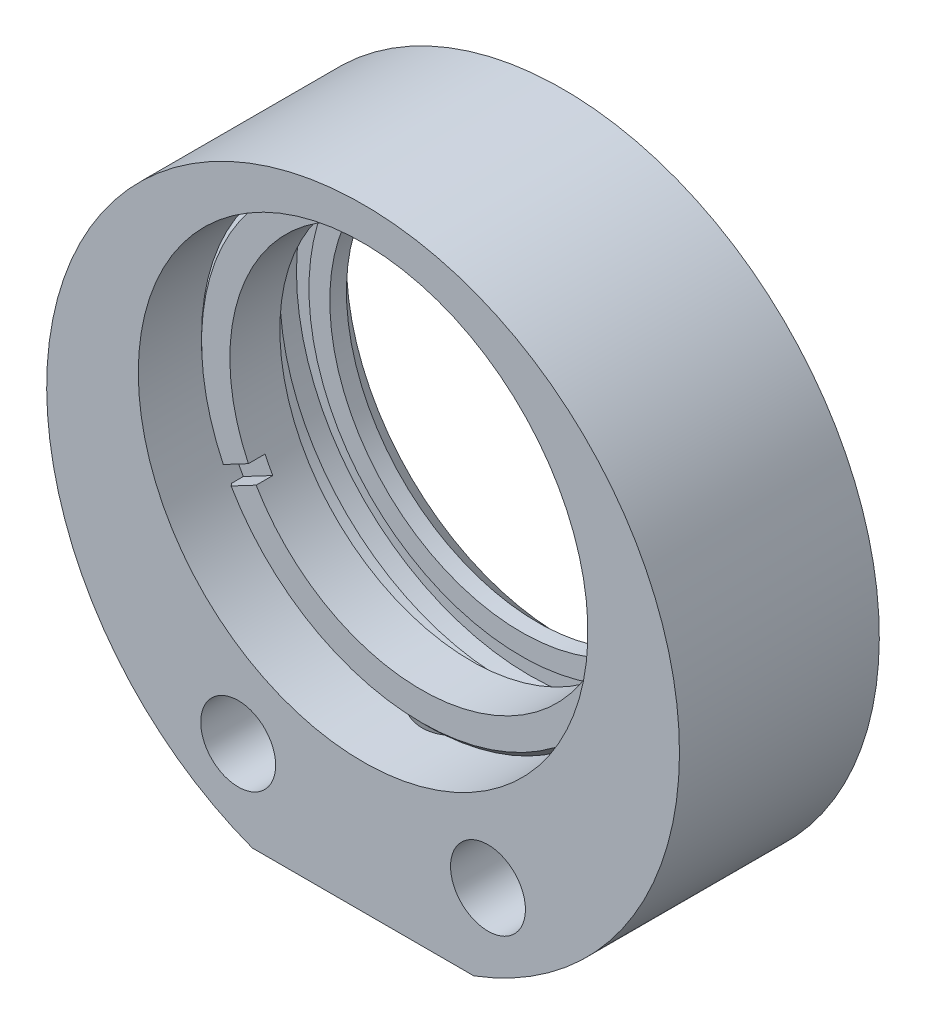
ISO-10303-21;
HEADER;
FILE_DESCRIPTION(('STEP AP214'),'2;1');
FILE_NAME('part.step','',(''),(''),'','','');
FILE_SCHEMA(('AUTOMOTIVE_DESIGN { 1 0 10303 214 1 1 1 1 }'));
ENDSEC;
DATA;
#1=APPLICATION_CONTEXT('core data for automotive mechanical design processes');
#2=APPLICATION_PROTOCOL_DEFINITION('international standard','automotive_design',2000,#1);
#3=PRODUCT_CONTEXT('',#1,'mechanical');
#4=PRODUCT('Part','Part','',(#3));
#5=PRODUCT_RELATED_PRODUCT_CATEGORY('part','',(#4));
#6=PRODUCT_DEFINITION_FORMATION('','',#4);
#7=PRODUCT_DEFINITION_CONTEXT('part definition',#1,'design');
#8=PRODUCT_DEFINITION('design','',#6,#7);
#9=PRODUCT_DEFINITION_SHAPE('','',#8);
#10=(LENGTH_UNIT() NAMED_UNIT(*) SI_UNIT(.MILLI.,.METRE.));
#11=(NAMED_UNIT(*) PLANE_ANGLE_UNIT() SI_UNIT($,.RADIAN.));
#12=(NAMED_UNIT(*) SI_UNIT($,.STERADIAN.) SOLID_ANGLE_UNIT());
#13=UNCERTAINTY_MEASURE_WITH_UNIT(LENGTH_MEASURE(1.E-05),#10,'distance_accuracy_value','');
#14=(GEOMETRIC_REPRESENTATION_CONTEXT(3) GLOBAL_UNCERTAINTY_ASSIGNED_CONTEXT((#13)) GLOBAL_UNIT_ASSIGNED_CONTEXT((#10,
#11,#12)) REPRESENTATION_CONTEXT('',''));
#15=CARTESIAN_POINT('',(0.,0.,0.));
#16=DIRECTION('',(0.,0.,1.));
#17=DIRECTION('',(1.,0.,0.));
#18=AXIS2_PLACEMENT_3D('',#15,#16,#17);
#19=CARTESIAN_POINT('',(-13.8252716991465,-4.37936876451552,8.5));
#20=DIRECTION('',(0.467610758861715,-0.883934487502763,0.));
#21=DIRECTION('',(0.883934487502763,0.467610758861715,0.));
#22=AXIS2_PLACEMENT_3D('',#19,#20,#21);
#23=PLANE('',#22);
#24=DIRECTION('',(0.883934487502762,0.467610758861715,0.));
#25=VECTOR('',#24,1.);
#26=CARTESIAN_POINT('',(-11.6911228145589,-3.25038127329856,7.5));
#27=LINE('',#26,#25);
#28=CARTESIAN_POINT('',(-11.6911228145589,-3.25038127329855,7.5));
#29=VERTEX_POINT('',#28);
#30=CARTESIAN_POINT('',(-9.92182869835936,-2.314405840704,7.5));
#31=VERTEX_POINT('',#30);
#32=EDGE_CURVE('E159',#29,#31,#27,.T.);
#33=ORIENTED_EDGE('',*,*,#32,.F.);
#34=DIRECTION('',(0.,0.,1.));
#35=VECTOR('',#34,1.);
#36=CARTESIAN_POINT('',(-11.6911228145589,-3.25038127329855,8.5));
#37=LINE('',#36,#35);
#38=CARTESIAN_POINT('',(-11.6911228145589,-3.25038127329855,8.2));
#39=VERTEX_POINT('',#38);
#40=EDGE_CURVE('E146',#39,#29,#37,.F.);
#41=ORIENTED_EDGE('',*,*,#40,.F.);
#42=CARTESIAN_POINT('',(-11.4257562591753,-3.10999953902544,8.5));
#43=CARTESIAN_POINT('',(-11.4699843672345,-3.13339667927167,8.45000039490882));
#44=CARTESIAN_POINT('',(-11.5142123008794,-3.15679372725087,8.40000059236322));
#45=CARTESIAN_POINT('',(-11.6026678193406,-3.20358763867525,8.30000059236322));
#46=CARTESIAN_POINT('',(-11.6468954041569,-3.22698450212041,8.25000039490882));
#47=CARTESIAN_POINT('',(-11.6911228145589,-3.25038127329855,8.2));
#48=B_SPLINE_CURVE_WITH_KNOTS('',3,(#42,#43,#44,#45,#46,#47),.UNSPECIFIED.,.F.,.F.,(4,2,4),(0.,
0.212206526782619,0.424413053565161),.UNSPECIFIED.);
#49=CARTESIAN_POINT('',(-11.4257562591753,-3.10999953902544,8.5));
#50=VERTEX_POINT('',#49);
#51=EDGE_CURVE('E20',#50,#39,#48,.T.);
#52=ORIENTED_EDGE('',*,*,#51,.F.);
#53=DIRECTION('',(0.883934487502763,0.467610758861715,0.));
#54=VECTOR('',#53,1.);
#55=CARTESIAN_POINT('',(-13.8252716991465,-4.37936876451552,8.5));
#56=LINE('',#55,#54);
#57=CARTESIAN_POINT('',(-9.92182869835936,-2.314405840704,8.5));
#58=VERTEX_POINT('',#57);
#59=EDGE_CURVE('E132',#58,#50,#56,.F.);
#60=ORIENTED_EDGE('',*,*,#59,.F.);
#61=DIRECTION('',(0.,0.,1.));
#62=VECTOR('',#61,1.);
#63=CARTESIAN_POINT('',(-9.92182869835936,-2.314405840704,8.5));
#64=LINE('',#63,#62);
#65=EDGE_CURVE('E161',#31,#58,#64,.T.);
#66=ORIENTED_EDGE('',*,*,#65,.F.);
#67=EDGE_LOOP('',(#33,#41,#52,#60,#66));
#68=FACE_BOUND('',#67,.T.);
#69=ADVANCED_FACE('F16',(#68),#23,.F.);
#70=CARTESIAN_POINT('',(12.6191860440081,10.7413366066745,8.5));
#71=DIRECTION('',(-0.467610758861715,0.883934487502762,0.));
#72=DIRECTION('',(-0.883934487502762,-0.467610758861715,0.));
#73=AXIS2_PLACEMENT_3D('',#70,#71,#72);
#74=PLANE('',#73);
#75=DIRECTION('',(-0.883934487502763,-0.467610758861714,0.));
#76=VECTOR('',#75,1.);
#77=CARTESIAN_POINT('',(11.6911228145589,10.2503812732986,7.5));
#78=LINE('',#77,#76);
#79=CARTESIAN_POINT('',(11.6911228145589,10.2503812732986,7.5));
#80=VERTEX_POINT('',#79);
#81=CARTESIAN_POINT('',(9.92182869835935,9.314405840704,7.5));
#82=VERTEX_POINT('',#81);
#83=EDGE_CURVE('E454',#80,#82,#78,.T.);
#84=ORIENTED_EDGE('',*,*,#83,.F.);
#85=DIRECTION('',(0.,0.,1.));
#86=VECTOR('',#85,1.);
#87=CARTESIAN_POINT('',(11.6911228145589,10.2503812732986,8.5));
#88=LINE('',#87,#86);
#89=CARTESIAN_POINT('',(11.6911228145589,10.2503812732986,8.2));
#90=VERTEX_POINT('',#89);
#91=EDGE_CURVE('E344',#90,#80,#88,.F.);
#92=ORIENTED_EDGE('',*,*,#91,.F.);
#93=CARTESIAN_POINT('',(11.4257562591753,10.1099995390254,8.5));
#94=CARTESIAN_POINT('',(11.4699843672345,10.1333966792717,8.45000039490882));
#95=CARTESIAN_POINT('',(11.5142123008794,10.1567937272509,8.40000059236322));
#96=CARTESIAN_POINT('',(11.6026678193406,10.2035876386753,8.30000059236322));
#97=CARTESIAN_POINT('',(11.6468954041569,10.2269845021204,8.25000039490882));
#98=CARTESIAN_POINT('',(11.6911228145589,10.2503812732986,8.2));
#99=B_SPLINE_CURVE_WITH_KNOTS('',3,(#93,#94,#95,#96,#97,#98),.UNSPECIFIED.,.F.,.F.,(4,2,4),(0.,
0.212206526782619,0.424413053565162),.UNSPECIFIED.);
#100=CARTESIAN_POINT('',(11.4257562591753,10.1099995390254,8.5));
#101=VERTEX_POINT('',#100);
#102=EDGE_CURVE('E171',#101,#90,#99,.T.);
#103=ORIENTED_EDGE('',*,*,#102,.F.);
#104=DIRECTION('',(-0.883934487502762,-0.467610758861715,0.));
#105=VECTOR('',#104,1.);
#106=CARTESIAN_POINT('',(12.6191860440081,10.7413366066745,8.5));
#107=LINE('',#106,#105);
#108=CARTESIAN_POINT('',(9.92182869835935,9.314405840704,8.5));
#109=VERTEX_POINT('',#108);
#110=EDGE_CURVE('E164',#109,#101,#107,.F.);
#111=ORIENTED_EDGE('',*,*,#110,.F.);
#112=DIRECTION('',(0.,0.,1.));
#113=VECTOR('',#112,1.);
#114=CARTESIAN_POINT('',(9.92182869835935,9.314405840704,8.5));
#115=LINE('',#114,#113);
#116=EDGE_CURVE('E167',#82,#109,#115,.T.);
#117=ORIENTED_EDGE('',*,*,#116,.F.);
#118=EDGE_LOOP('',(#84,#92,#103,#111,#117));
#119=FACE_BOUND('',#118,.T.);
#120=ADVANCED_FACE('F347',(#119),#74,.F.);
#121=CARTESIAN_POINT('',(-0.603042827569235,3.18098392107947,7.5));
#122=DIRECTION('',(0.,0.,1.));
#123=DIRECTION('',(0.,-1.,0.));
#124=AXIS2_PLACEMENT_3D('',#121,#122,#123);
#125=PLANE('',#124);
#126=CARTESIAN_POINT('',(0.,3.5,7.5));
#127=DIRECTION('',(0.,0.,-1.));
#128=DIRECTION('',(-1.,0.,0.));
#129=AXIS2_PLACEMENT_3D('',#126,#127,#128);
#130=CIRCLE('',#129,13.5);
#131=CARTESIAN_POINT('',(-12.1587335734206,-2.36644678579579,7.5));
#132=VERTEX_POINT('',#131);
#133=EDGE_CURVE('E461',#132,#29,#130,.F.);
#134=ORIENTED_EDGE('',*,*,#133,.T.);
#135=ORIENTED_EDGE('',*,*,#32,.T.);
#136=CARTESIAN_POINT('',(0.,3.5,7.5));
#137=DIRECTION('',(0.,0.,1.));
#138=DIRECTION('',(1.,0.,0.));
#139=AXIS2_PLACEMENT_3D('',#136,#137,#138);
#140=CIRCLE('',#139,11.5);
#141=CARTESIAN_POINT('',(-10.3894394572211,-1.43047135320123,7.5));
#142=VERTEX_POINT('',#141);
#143=EDGE_CURVE('E345',#31,#142,#140,.F.);
#144=ORIENTED_EDGE('',*,*,#143,.T.);
#145=DIRECTION('',(-0.883934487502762,-0.467610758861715,0.));
#146=VECTOR('',#145,1.);
#147=CARTESIAN_POINT('',(12.6191860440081,10.7413366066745,7.5));
#148=LINE('',#147,#146);
#149=EDGE_CURVE('E450',#142,#132,#148,.T.);
#150=ORIENTED_EDGE('',*,*,#149,.T.);
#151=EDGE_LOOP('',(#134,#135,#144,#150));
#152=FACE_BOUND('',#151,.T.);
#153=ADVANCED_FACE('F351',(#152),#125,.T.);
#154=CARTESIAN_POINT('',(-0.603042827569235,3.18098392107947,7.5));
#155=DIRECTION('',(0.,0.,1.));
#156=DIRECTION('',(0.,-1.,0.));
#157=AXIS2_PLACEMENT_3D('',#154,#155,#156);
#158=PLANE('',#157);
#159=CARTESIAN_POINT('',(0.,3.5,7.5));
#160=DIRECTION('',(0.,0.,-1.));
#161=DIRECTION('',(-1.,0.,0.));
#162=AXIS2_PLACEMENT_3D('',#159,#160,#161);
#163=CIRCLE('',#162,13.5);
#164=CARTESIAN_POINT('',(12.1587335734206,9.36644678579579,7.5));
#165=VERTEX_POINT('',#164);
#166=EDGE_CURVE('E466',#165,#80,#163,.F.);
#167=ORIENTED_EDGE('',*,*,#166,.T.);
#168=ORIENTED_EDGE('',*,*,#83,.T.);
#169=CARTESIAN_POINT('',(0.,3.5,7.5));
#170=DIRECTION('',(0.,0.,1.));
#171=DIRECTION('',(1.,0.,0.));
#172=AXIS2_PLACEMENT_3D('',#169,#170,#171);
#173=CIRCLE('',#172,11.5);
#174=CARTESIAN_POINT('',(10.3894394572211,8.43047135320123,7.5));
#175=VERTEX_POINT('',#174);
#176=EDGE_CURVE('E463',#82,#175,#173,.F.);
#177=ORIENTED_EDGE('',*,*,#176,.T.);
#178=DIRECTION('',(0.883934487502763,0.467610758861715,0.));
#179=VECTOR('',#178,1.);
#180=CARTESIAN_POINT('',(-13.8252716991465,-4.37936876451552,7.5));
#181=LINE('',#180,#179);
#182=EDGE_CURVE('E445',#175,#165,#181,.T.);
#183=ORIENTED_EDGE('',*,*,#182,.T.);
#184=EDGE_LOOP('',(#167,#168,#177,#183));
#185=FACE_BOUND('',#184,.T.);
#186=ADVANCED_FACE('F356',(#185),#158,.T.);
#187=CARTESIAN_POINT('',(0.,3.5,2.));
#188=DIRECTION('',(0.,0.,-1.));
#189=DIRECTION('',(-1.,0.,0.));
#190=AXIS2_PLACEMENT_3D('',#187,#188,#189);
#191=PLANE('',#190);
#192=CARTESIAN_POINT('',(0.,3.5,2.));
#193=DIRECTION('',(0.,0.,1.));
#194=DIRECTION('',(1.,0.,0.));
#195=AXIS2_PLACEMENT_3D('',#192,#193,#194);
#196=CIRCLE('',#195,12.75);
#197=CARTESIAN_POINT('',(12.75,3.5,2.));
#198=VERTEX_POINT('',#197);
#199=EDGE_CURVE('E390',#198,#198,#196,.T.);
#200=ORIENTED_EDGE('',*,*,#199,.F.);
#201=EDGE_LOOP('',(#200));
#202=FACE_BOUND('',#201,.T.);
#203=CARTESIAN_POINT('',(0.,3.5,2.));
#204=DIRECTION('',(0.,0.,1.));
#205=DIRECTION('',(1.,0.,0.));
#206=AXIS2_PLACEMENT_3D('',#203,#204,#205);
#207=CIRCLE('',#206,14.);
#208=CARTESIAN_POINT('',(14.,3.5,2.));
#209=VERTEX_POINT('',#208);
#210=EDGE_CURVE('E393',#209,#209,#207,.T.);
#211=ORIENTED_EDGE('',*,*,#210,.T.);
#212=EDGE_LOOP('',(#211));
#213=FACE_BOUND('',#212,.T.);
#214=ADVANCED_FACE('F360',(#202,#213),#191,.F.);
#215=CARTESIAN_POINT('',(0.,3.5,5.5));
#216=DIRECTION('',(0.,0.,1.));
#217=DIRECTION('',(1.,0.,0.));
#218=AXIS2_PLACEMENT_3D('',#215,#216,#217);
#219=CYLINDRICAL_SURFACE('',#218,12.75);
#220=CARTESIAN_POINT('',(0.,3.5,6.));
#221=DIRECTION('',(0.,0.,1.));
#222=DIRECTION('',(1.,0.,0.));
#223=AXIS2_PLACEMENT_3D('',#220,#221,#222);
#224=CIRCLE('',#223,12.75);
#225=CARTESIAN_POINT('',(12.75,3.5,6.));
#226=VERTEX_POINT('',#225);
#227=EDGE_CURVE('E396',#226,#226,#224,.T.);
#228=ORIENTED_EDGE('',*,*,#227,.F.);
#229=EDGE_LOOP('',(#228));
#230=FACE_BOUND('',#229,.T.);
#231=CARTESIAN_POINT('',(0.,3.5,5.5));
#232=DIRECTION('',(0.,0.,1.));
#233=DIRECTION('',(1.,0.,0.));
#234=AXIS2_PLACEMENT_3D('',#231,#232,#233);
#235=CIRCLE('',#234,12.75);
#236=CARTESIAN_POINT('',(12.75,3.5,5.5));
#237=VERTEX_POINT('',#236);
#238=EDGE_CURVE('E387',#237,#237,#235,.F.);
#239=ORIENTED_EDGE('',*,*,#238,.F.);
#240=EDGE_LOOP('',(#239));
#241=FACE_BOUND('',#240,.T.);
#242=ADVANCED_FACE('F364',(#230,#241),#219,.T.);
#243=CARTESIAN_POINT('',(12.6191860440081,10.7413366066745,8.5));
#244=DIRECTION('',(-0.467610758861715,0.883934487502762,0.));
#245=DIRECTION('',(-0.883934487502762,-0.467610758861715,0.));
#246=AXIS2_PLACEMENT_3D('',#243,#244,#245);
#247=PLANE('',#246);
#248=DIRECTION('',(-0.883934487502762,-0.467610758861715,0.));
#249=VECTOR('',#248,1.);
#250=CARTESIAN_POINT('',(12.6191860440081,10.7413366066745,8.5));
#251=LINE('',#250,#249);
#252=CARTESIAN_POINT('',(-11.893367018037,-2.22606505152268,8.5));
#253=VERTEX_POINT('',#252);
#254=CARTESIAN_POINT('',(-10.3894394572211,-1.43047135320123,8.5));
#255=VERTEX_POINT('',#254);
#256=EDGE_CURVE('E448',#253,#255,#251,.F.);
#257=ORIENTED_EDGE('',*,*,#256,.F.);
#258=CARTESIAN_POINT('',(-12.1587335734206,-2.36644678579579,8.2));
#259=CARTESIAN_POINT('',(-12.1145061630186,-2.34305001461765,8.25000039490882));
#260=CARTESIAN_POINT('',(-12.0702785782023,-2.31965315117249,8.30000059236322));
#261=CARTESIAN_POINT('',(-11.9818230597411,-2.27285923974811,8.40000059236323));
#262=CARTESIAN_POINT('',(-11.9375951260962,-2.2494621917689,8.45000039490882));
#263=CARTESIAN_POINT('',(-11.893367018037,-2.22606505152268,8.5));
#264=B_SPLINE_CURVE_WITH_KNOTS('',3,(#258,#259,#260,#261,#262,#263),.UNSPECIFIED.,.F.,.F.,(4,2,
4),(0.,0.212206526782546,0.424413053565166),.UNSPECIFIED.);
#265=CARTESIAN_POINT('',(-12.1587335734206,-2.36644678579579,8.2));
#266=VERTEX_POINT('',#265);
#267=EDGE_CURVE('E331',#266,#253,#264,.T.);
#268=ORIENTED_EDGE('',*,*,#267,.F.);
#269=DIRECTION('',(0.,0.,1.));
#270=VECTOR('',#269,1.);
#271=CARTESIAN_POINT('',(-12.1587335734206,-2.3664467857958,8.5));
#272=LINE('',#271,#270);
#273=EDGE_CURVE('E453',#132,#266,#272,.T.);
#274=ORIENTED_EDGE('',*,*,#273,.F.);
#275=ORIENTED_EDGE('',*,*,#149,.F.);
#276=DIRECTION('',(0.,0.,1.));
#277=VECTOR('',#276,1.);
#278=CARTESIAN_POINT('',(-10.3894394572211,-1.43047135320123,5.5));
#279=LINE('',#278,#277);
#280=EDGE_CURVE('E399',#142,#255,#279,.T.);
#281=ORIENTED_EDGE('',*,*,#280,.T.);
#282=EDGE_LOOP('',(#257,#268,#274,#275,#281));
#283=FACE_BOUND('',#282,.T.);
#284=ADVANCED_FACE('F367',(#283),#247,.F.);
#285=CARTESIAN_POINT('',(-13.8252716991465,-4.37936876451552,8.5));
#286=DIRECTION('',(0.467610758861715,-0.883934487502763,0.));
#287=DIRECTION('',(0.883934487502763,0.467610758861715,0.));
#288=AXIS2_PLACEMENT_3D('',#285,#286,#287);
#289=PLANE('',#288);
#290=DIRECTION('',(0.883934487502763,0.467610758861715,0.));
#291=VECTOR('',#290,1.);
#292=CARTESIAN_POINT('',(-13.8252716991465,-4.37936876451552,8.5));
#293=LINE('',#292,#291);
#294=CARTESIAN_POINT('',(11.893367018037,9.22606505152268,8.5));
#295=VERTEX_POINT('',#294);
#296=CARTESIAN_POINT('',(10.3894394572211,8.43047135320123,8.5));
#297=VERTEX_POINT('',#296);
#298=EDGE_CURVE('E385',#295,#297,#293,.F.);
#299=ORIENTED_EDGE('',*,*,#298,.F.);
#300=CARTESIAN_POINT('',(12.1587335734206,9.3664467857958,8.2));
#301=CARTESIAN_POINT('',(12.1145061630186,9.34305001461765,8.25000039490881));
#302=CARTESIAN_POINT('',(12.0702785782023,9.31965315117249,8.30000059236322));
#303=CARTESIAN_POINT('',(11.9818230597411,9.27285923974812,8.40000059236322));
#304=CARTESIAN_POINT('',(11.9375951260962,9.24946219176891,8.45000039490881));
#305=CARTESIAN_POINT('',(11.893367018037,9.22606505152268,8.49999999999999));
#306=B_SPLINE_CURVE_WITH_KNOTS('',3,(#300,#301,#302,#303,#304,#305),.UNSPECIFIED.,.F.,.F.,(4,2,
4),(0.,0.212206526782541,0.424413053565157),.UNSPECIFIED.);
#307=CARTESIAN_POINT('',(12.1587335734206,9.36644678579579,8.2));
#308=VERTEX_POINT('',#307);
#309=EDGE_CURVE('E380',#308,#295,#306,.T.);
#310=ORIENTED_EDGE('',*,*,#309,.F.);
#311=DIRECTION('',(0.,0.,1.));
#312=VECTOR('',#311,1.);
#313=CARTESIAN_POINT('',(12.1587335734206,9.3664467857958,8.5));
#314=LINE('',#313,#312);
#315=EDGE_CURVE('E386',#165,#308,#314,.T.);
#316=ORIENTED_EDGE('',*,*,#315,.F.);
#317=ORIENTED_EDGE('',*,*,#182,.F.);
#318=DIRECTION('',(0.,0.,1.));
#319=VECTOR('',#318,1.);
#320=CARTESIAN_POINT('',(10.3894394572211,8.43047135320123,5.5));
#321=LINE('',#320,#319);
#322=EDGE_CURVE('E404',#175,#297,#321,.T.);
#323=ORIENTED_EDGE('',*,*,#322,.T.);
#324=EDGE_LOOP('',(#299,#310,#316,#317,#323));
#325=FACE_BOUND('',#324,.T.);
#326=ADVANCED_FACE('F372',(#325),#289,.F.);
#327=CARTESIAN_POINT('',(0.,3.5,5.5));
#328=DIRECTION('',(0.,0.,-1.));
#329=DIRECTION('',(-1.,0.,0.));
#330=AXIS2_PLACEMENT_3D('',#327,#328,#329);
#331=PLANE('',#330);
#332=ORIENTED_EDGE('',*,*,#238,.T.);
#333=EDGE_LOOP('',(#332));
#334=FACE_BOUND('',#333,.T.);
#335=CARTESIAN_POINT('',(0.,3.5,5.5));
#336=DIRECTION('',(0.,0.,1.));
#337=DIRECTION('',(1.,0.,0.));
#338=AXIS2_PLACEMENT_3D('',#335,#336,#337);
#339=CIRCLE('',#338,11.5);
#340=CARTESIAN_POINT('',(11.5,3.5,5.5));
#341=VERTEX_POINT('',#340);
#342=EDGE_CURVE('E400',#341,#341,#339,.T.);
#343=ORIENTED_EDGE('',*,*,#342,.T.);
#344=EDGE_LOOP('',(#343));
#345=FACE_BOUND('',#344,.T.);
#346=ADVANCED_FACE('F377',(#334,#345),#331,.T.);
#347=CARTESIAN_POINT('',(0.,3.5,2.));
#348=DIRECTION('',(0.,0.,1.));
#349=DIRECTION('',(1.,0.,0.));
#350=AXIS2_PLACEMENT_3D('',#347,#348,#349);
#351=CYLINDRICAL_SURFACE('',#350,12.75);
#352=ORIENTED_EDGE('',*,*,#199,.T.);
#353=EDGE_LOOP('',(#352));
#354=FACE_BOUND('',#353,.T.);
#355=CARTESIAN_POINT('',(0.,3.5,2.5));
#356=DIRECTION('',(0.,0.,1.));
#357=DIRECTION('',(1.,0.,0.));
#358=AXIS2_PLACEMENT_3D('',#355,#356,#357);
#359=CIRCLE('',#358,12.75);
#360=CARTESIAN_POINT('',(12.75,3.5,2.5));
#361=VERTEX_POINT('',#360);
#362=EDGE_CURVE('E403',#361,#361,#359,.F.);
#363=ORIENTED_EDGE('',*,*,#362,.T.);
#364=EDGE_LOOP('',(#363));
#365=FACE_BOUND('',#364,.T.);
#366=ADVANCED_FACE('F555',(#354,#365),#351,.T.);
#367=CARTESIAN_POINT('',(0.,3.5,2.75));
#368=DIRECTION('',(0.,0.,1.));
#369=DIRECTION('',(1.,0.,0.));
#370=AXIS2_PLACEMENT_3D('',#367,#368,#369);
#371=CYLINDRICAL_SURFACE('',#370,14.);
#372=ORIENTED_EDGE('',*,*,#210,.F.);
#373=EDGE_LOOP('',(#372));
#374=FACE_BOUND('',#373,.T.);
#375=CARTESIAN_POINT('',(0.,3.5,3.5));
#376=DIRECTION('',(0.,0.,1.));
#377=DIRECTION('',(1.,0.,0.));
#378=AXIS2_PLACEMENT_3D('',#375,#376,#377);
#379=CIRCLE('',#378,14.);
#380=CARTESIAN_POINT('',(14.,3.5,3.5));
#381=VERTEX_POINT('',#380);
#382=EDGE_CURVE('E407',#381,#381,#379,.T.);
#383=ORIENTED_EDGE('',*,*,#382,.T.);
#384=EDGE_LOOP('',(#383));
#385=FACE_BOUND('',#384,.T.);
#386=ADVANCED_FACE('F526',(#374,#385),#371,.F.);
#387=CARTESIAN_POINT('',(0.,3.5,6.));
#388=DIRECTION('',(0.,0.,-1.));
#389=DIRECTION('',(-1.,0.,0.));
#390=AXIS2_PLACEMENT_3D('',#387,#388,#389);
#391=PLANE('',#390);
#392=ORIENTED_EDGE('',*,*,#227,.T.);
#393=EDGE_LOOP('',(#392));
#394=FACE_BOUND('',#393,.T.);
#395=CARTESIAN_POINT('',(0.,3.5,6.));
#396=DIRECTION('',(0.,0.,1.));
#397=DIRECTION('',(1.,0.,0.));
#398=AXIS2_PLACEMENT_3D('',#395,#396,#397);
#399=CIRCLE('',#398,13.2);
#400=CARTESIAN_POINT('',(13.2,3.5,6.));
#401=VERTEX_POINT('',#400);
#402=EDGE_CURVE('E410',#401,#401,#399,.T.);
#403=ORIENTED_EDGE('',*,*,#402,.F.);
#404=EDGE_LOOP('',(#403));
#405=FACE_BOUND('',#404,.T.);
#406=ADVANCED_FACE('F517',(#394,#405),#391,.T.);
#407=CARTESIAN_POINT('',(0.,3.5,5.5));
#408=DIRECTION('',(0.,0.,1.));
#409=DIRECTION('',(1.,0.,0.));
#410=AXIS2_PLACEMENT_3D('',#407,#408,#409);
#411=CYLINDRICAL_SURFACE('',#410,11.5);
#412=ORIENTED_EDGE('',*,*,#342,.F.);
#413=EDGE_LOOP('',(#412));
#414=FACE_BOUND('',#413,.T.);
#415=ORIENTED_EDGE('',*,*,#65,.T.);
#416=CARTESIAN_POINT('',(0.,3.5,8.5));
#417=DIRECTION('',(0.,0.,1.));
#418=DIRECTION('',(1.,0.,0.));
#419=AXIS2_PLACEMENT_3D('',#416,#417,#418);
#420=CIRCLE('',#419,11.5);
#421=EDGE_CURVE('E415',#58,#297,#420,.T.);
#422=ORIENTED_EDGE('',*,*,#421,.T.);
#423=ORIENTED_EDGE('',*,*,#322,.F.);
#424=ORIENTED_EDGE('',*,*,#176,.F.);
#425=ORIENTED_EDGE('',*,*,#116,.T.);
#426=CARTESIAN_POINT('',(0.,3.5,8.5));
#427=DIRECTION('',(0.,0.,1.));
#428=DIRECTION('',(1.,0.,0.));
#429=AXIS2_PLACEMENT_3D('',#426,#427,#428);
#430=CIRCLE('',#429,11.5);
#431=EDGE_CURVE('E413',#109,#255,#430,.T.);
#432=ORIENTED_EDGE('',*,*,#431,.T.);
#433=ORIENTED_EDGE('',*,*,#280,.F.);
#434=ORIENTED_EDGE('',*,*,#143,.F.);
#435=EDGE_LOOP('',(#415,#422,#423,#424,#425,#432,#433,#434));
#436=FACE_BOUND('',#435,.T.);
#437=ADVANCED_FACE('F515',(#414,#436),#411,.F.);
#438=CARTESIAN_POINT('',(0.,3.5,2.5));
#439=DIRECTION('',(0.,0.,-1.));
#440=DIRECTION('',(-1.,0.,0.));
#441=AXIS2_PLACEMENT_3D('',#438,#439,#440);
#442=PLANE('',#441);
#443=ORIENTED_EDGE('',*,*,#362,.F.);
#444=EDGE_LOOP('',(#443));
#445=FACE_BOUND('',#444,.T.);
#446=CARTESIAN_POINT('',(0.,3.5,2.5));
#447=DIRECTION('',(0.,0.,1.));
#448=DIRECTION('',(1.,0.,0.));
#449=AXIS2_PLACEMENT_3D('',#446,#447,#448);
#450=CIRCLE('',#449,11.5);
#451=CARTESIAN_POINT('',(11.5,3.5,2.5));
#452=VERTEX_POINT('',#451);
#453=EDGE_CURVE('E284',#452,#452,#450,.F.);
#454=ORIENTED_EDGE('',*,*,#453,.T.);
#455=EDGE_LOOP('',(#454));
#456=FACE_BOUND('',#455,.T.);
#457=ADVANCED_FACE('F422',(#445,#456),#442,.F.);
#458=CARTESIAN_POINT('',(0.,3.5,3.5));
#459=DIRECTION('',(0.,0.,1.));
#460=DIRECTION('',(1.,0.,0.));
#461=AXIS2_PLACEMENT_3D('',#458,#459,#460);
#462=PLANE('',#461);
#463=ORIENTED_EDGE('',*,*,#382,.F.);
#464=EDGE_LOOP('',(#463));
#465=FACE_BOUND('',#464,.T.);
#466=CARTESIAN_POINT('',(0.,3.5,3.5));
#467=DIRECTION('',(0.,0.,-1.));
#468=DIRECTION('',(-1.,0.,0.));
#469=AXIS2_PLACEMENT_3D('',#466,#467,#468);
#470=CIRCLE('',#469,13.5);
#471=CARTESIAN_POINT('',(-13.5,3.5,3.5));
#472=VERTEX_POINT('',#471);
#473=EDGE_CURVE('E279',#472,#472,#470,.F.);
#474=ORIENTED_EDGE('',*,*,#473,.T.);
#475=EDGE_LOOP('',(#474));
#476=FACE_BOUND('',#475,.T.);
#477=ADVANCED_FACE('F522',(#465,#476),#462,.F.);
#478=CARTESIAN_POINT('',(0.,3.5,6.3));
#479=DIRECTION('',(0.,0.,1.));
#480=DIRECTION('',(1.,0.,0.));
#481=AXIS2_PLACEMENT_3D('',#478,#479,#480);
#482=CONICAL_SURFACE('',#481,13.5,0.785398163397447);
#483=CARTESIAN_POINT('',(0.,3.5,6.3));
#484=DIRECTION('',(0.,0.,1.));
#485=DIRECTION('',(1.,0.,0.));
#486=AXIS2_PLACEMENT_3D('',#483,#484,#485);
#487=CIRCLE('',#486,13.5);
#488=CARTESIAN_POINT('',(-2.41142582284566,-9.78288468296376,6.29999999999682));
#489=VERTEX_POINT('',#488);
#490=CARTESIAN_POINT('',(2.41142582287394,-9.78288468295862,6.29999999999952));
#491=VERTEX_POINT('',#490);
#492=EDGE_CURVE('E280',#489,#491,#487,.T.);
#493=ORIENTED_EDGE('',*,*,#492,.F.);
#494=CARTESIAN_POINT('',(0.,3.5,6.3));
#495=DIRECTION('',(0.,0.,-1.));
#496=DIRECTION('',(-1.,0.,0.));
#497=AXIS2_PLACEMENT_3D('',#494,#495,#496);
#498=CIRCLE('',#497,13.5);
#499=EDGE_CURVE('E306',#489,#491,#498,.T.);
#500=ORIENTED_EDGE('',*,*,#499,.T.);
#501=EDGE_LOOP('',(#493,#500));
#502=FACE_BOUND('',#501,.T.);
#503=ORIENTED_EDGE('',*,*,#402,.T.);
#504=EDGE_LOOP('',(#503));
#505=FACE_BOUND('',#504,.T.);
#506=ADVANCED_FACE('F534',(#502,#505),#482,.T.);
#507=CARTESIAN_POINT('',(0.,3.5,8.5));
#508=DIRECTION('',(0.,0.,-1.));
#509=DIRECTION('',(-1.,0.,0.));
#510=AXIS2_PLACEMENT_3D('',#507,#508,#509);
#511=PLANE('',#510);
#512=CARTESIAN_POINT('',(0.,3.5,8.5));
#513=DIRECTION('',(0.,0.,-1.));
#514=DIRECTION('',(0.,1.,0.));
#515=AXIS2_PLACEMENT_3D('',#512,#513,#514);
#516=CIRCLE('',#515,13.2);
#517=EDGE_CURVE('E496',#253,#101,#516,.T.);
#518=ORIENTED_EDGE('',*,*,#517,.F.);
#519=ORIENTED_EDGE('',*,*,#256,.T.);
#520=ORIENTED_EDGE('',*,*,#431,.F.);
#521=ORIENTED_EDGE('',*,*,#110,.T.);
#522=EDGE_LOOP('',(#518,#519,#520,#521));
#523=FACE_BOUND('',#522,.T.);
#524=ADVANCED_FACE('F495',(#523),#511,.F.);
#525=CARTESIAN_POINT('',(0.,3.5,8.5));
#526=DIRECTION('',(0.,0.,-1.));
#527=DIRECTION('',(-1.,0.,0.));
#528=AXIS2_PLACEMENT_3D('',#525,#526,#527);
#529=PLANE('',#528);
#530=ORIENTED_EDGE('',*,*,#421,.F.);
#531=ORIENTED_EDGE('',*,*,#59,.T.);
#532=CARTESIAN_POINT('',(0.,3.5,8.5));
#533=DIRECTION('',(0.,0.,-1.));
#534=DIRECTION('',(0.,1.,0.));
#535=AXIS2_PLACEMENT_3D('',#532,#533,#534);
#536=CIRCLE('',#535,13.2);
#537=EDGE_CURVE('E143',#295,#50,#536,.T.);
#538=ORIENTED_EDGE('',*,*,#537,.F.);
#539=ORIENTED_EDGE('',*,*,#298,.T.);
#540=EDGE_LOOP('',(#530,#531,#538,#539));
#541=FACE_BOUND('',#540,.T.);
#542=ADVANCED_FACE('F427',(#541),#529,.F.);
#543=CARTESIAN_POINT('',(0.,3.5,2.));
#544=DIRECTION('',(0.,0.,1.));
#545=DIRECTION('',(1.,0.,0.));
#546=AXIS2_PLACEMENT_3D('',#543,#544,#545);
#547=CYLINDRICAL_SURFACE('',#546,11.5);
#548=ORIENTED_EDGE('',*,*,#453,.F.);
#549=EDGE_LOOP('',(#548));
#550=FACE_BOUND('',#549,.T.);
#551=CARTESIAN_POINT('',(0.,3.5,1.5));
#552=DIRECTION('',(0.,0.,-1.));
#553=DIRECTION('',(1.,0.,0.));
#554=AXIS2_PLACEMENT_3D('',#551,#552,#553);
#555=CIRCLE('',#554,11.5);
#556=CARTESIAN_POINT('',(11.5,3.5,1.5));
#557=VERTEX_POINT('',#556);
#558=EDGE_CURVE('E430',#557,#557,#555,.F.);
#559=ORIENTED_EDGE('',*,*,#558,.F.);
#560=EDGE_LOOP('',(#559));
#561=FACE_BOUND('',#560,.T.);
#562=ADVANCED_FACE('F424',(#550,#561),#547,.F.);
#563=CARTESIAN_POINT('',(0.,3.5,6.));
#564=DIRECTION('',(0.,0.,1.));
#565=DIRECTION('',(1.,0.,0.));
#566=AXIS2_PLACEMENT_3D('',#563,#564,#565);
#567=CYLINDRICAL_SURFACE('',#566,13.5);
#568=CARTESIAN_POINT('',(2.31516738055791,-9.80000000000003,6.82717727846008));
#569=CARTESIAN_POINT('',(2.29186944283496,-9.8040531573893,6.89240478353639));
#570=CARTESIAN_POINT('',(2.26581301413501,-9.80852816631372,6.95661479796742));
#571=CARTESIAN_POINT('',(2.20840666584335,-9.81817569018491,7.08256328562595));
#572=CARTESIAN_POINT('',(2.17705715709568,-9.82334815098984,7.14430195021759));
#573=CARTESIAN_POINT('',(2.10925134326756,-9.83425037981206,7.26494034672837));
#574=CARTESIAN_POINT('',(2.07279007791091,-9.83998068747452,7.32383724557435));
#575=CARTESIAN_POINT('',(1.99506519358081,-9.85182617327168,7.43830729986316));
#576=CARTESIAN_POINT('',(1.95380173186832,-9.85794133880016,7.49388056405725));
#577=CARTESIAN_POINT('',(1.82319820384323,-9.87660929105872,7.6550734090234));
#578=CARTESIAN_POINT('',(1.72701088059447,-9.88949027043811,7.7552265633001));
#579=CARTESIAN_POINT('',(1.51932765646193,-9.91463788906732,7.93776345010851));
#580=CARTESIAN_POINT('',(1.40786760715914,-9.92690587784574,8.02018766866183));
#581=CARTESIAN_POINT('',(1.25902317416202,-9.94120021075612,8.11197700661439));
#582=CARTESIAN_POINT('',(1.22723661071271,-9.94414144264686,8.13060399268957));
#583=CARTESIAN_POINT('',(1.16288483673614,-9.94986010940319,8.16639594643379));
#584=CARTESIAN_POINT('',(1.1303205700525,-9.95263772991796,8.18356258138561));
#585=CARTESIAN_POINT('',(1.09737060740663,-9.95532525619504,8.2));
#586=B_SPLINE_CURVE_WITH_KNOTS('',3,(#568,#569,#570,#571,#572,#573,#574,#575,#576,#577,#578,
#579,#580,#581,#582,#583,#584,#585),.UNSPECIFIED.,.F.,.F.,(4,2,2,2,2,2,2,2,4),(0.,
0.208073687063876,0.416131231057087,0.624392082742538,0.832646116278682,1.2489477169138,
1.66428830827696,1.77514228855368,1.88586795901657),.UNSPECIFIED.);
#587=CARTESIAN_POINT('',(2.31516738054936,-9.80000000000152,6.82717727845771));
#588=VERTEX_POINT('',#587);
#589=CARTESIAN_POINT('',(1.09737060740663,-9.95532525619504,8.2));
#590=VERTEX_POINT('',#589);
#591=EDGE_CURVE('E276',#588,#590,#586,.T.);
#592=ORIENTED_EDGE('',*,*,#591,.T.);
#593=CARTESIAN_POINT('',(0.,3.5,8.2));
#594=DIRECTION('',(0.,0.,-1.));
#595=DIRECTION('',(-0.883934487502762,-0.467610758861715,0.));
#596=AXIS2_PLACEMENT_3D('',#593,#594,#595);
#597=CIRCLE('',#596,13.5);
#598=CARTESIAN_POINT('',(-1.09737060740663,-9.95532525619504,8.2));
#599=VERTEX_POINT('',#598);
#600=EDGE_CURVE('E275',#599,#590,#597,.F.);
#601=ORIENTED_EDGE('',*,*,#600,.F.);
#602=CARTESIAN_POINT('',(-1.09737060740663,-9.95532525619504,8.2));
#603=CARTESIAN_POINT('',(-1.15942534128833,-9.95026704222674,8.16905371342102));
#604=CARTESIAN_POINT('',(-1.22013924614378,-9.94488053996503,8.13548401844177));
#605=CARTESIAN_POINT('',(-1.3384827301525,-9.93361371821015,8.06336613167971));
#606=CARTESIAN_POINT('',(-1.3961124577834,-9.92773342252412,8.0248181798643));
#607=CARTESIAN_POINT('',(-1.5079628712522,-9.91563347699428,7.94295644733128));
#608=CARTESIAN_POINT('',(-1.56217907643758,-9.9094134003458,7.89963659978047));
#609=CARTESIAN_POINT('',(-1.66673590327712,-9.89681923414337,7.80859708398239));
#610=CARTESIAN_POINT('',(-1.71707668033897,-9.89044515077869,7.76087759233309));
#611=CARTESIAN_POINT('',(-1.86180567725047,-9.87135518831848,7.61154961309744));
#612=CARTESIAN_POINT('',(-1.94993892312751,-9.85866725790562,7.50374348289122));
#613=CARTESIAN_POINT('',(-2.10664027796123,-9.83485564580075,7.2749350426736));
#614=CARTESIAN_POINT('',(-2.17525586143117,-9.82372820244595,7.15396575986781));
#615=CARTESIAN_POINT('',(-2.24832127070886,-9.81147180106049,6.99528462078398));
#616=CARTESIAN_POINT('',(-2.26273331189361,-9.8090281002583,6.96206800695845));
#617=CARTESIAN_POINT('',(-2.2900661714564,-9.80435231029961,6.89505500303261));
#618=CARTESIAN_POINT('',(-2.30298861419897,-9.80211999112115,6.86125929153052));
#619=CARTESIAN_POINT('',(-2.31516738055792,-9.80000000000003,6.82717727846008));
#620=B_SPLINE_CURVE_WITH_KNOTS('',3,(#602,#603,#604,#605,#606,#607,#608,#609,#610,#611,#612,
#613,#614,#615,#616,#617,#618,#619),.UNSPECIFIED.,.F.,.F.,(4,2,2,2,2,2,2,2,4),(0.,
0.208510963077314,0.417011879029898,0.625781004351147,0.834541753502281,1.25192176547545,
1.66827769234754,1.77712705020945,1.88585656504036),.UNSPECIFIED.);
#621=CARTESIAN_POINT('',(-2.31516738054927,-9.80000000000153,6.82717727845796));
#622=VERTEX_POINT('',#621);
#623=EDGE_CURVE('E263',#599,#622,#620,.T.);
#624=ORIENTED_EDGE('',*,*,#623,.T.);
#625=CARTESIAN_POINT('',(-2.31516738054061,-9.80000000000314,6.82717727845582));
#626=CARTESIAN_POINT('',(-2.33874441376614,-9.79586449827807,6.7407326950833));
#627=CARTESIAN_POINT('',(-2.35855442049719,-9.7923704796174,6.6535794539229));
#628=CARTESIAN_POINT('',(-2.39064073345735,-9.78666534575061,6.47785372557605));
#629=CARTESIAN_POINT('',(-2.40291687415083,-9.78445425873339,6.38928120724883));
#630=CARTESIAN_POINT('',(-2.41142582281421,-9.78288468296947,6.29999999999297));
#631=B_SPLINE_CURVE_WITH_KNOTS('',3,(#625,#626,#627,#628,#629,#630),.UNSPECIFIED.,.F.,.F.,(4,2,
4),(0.,0.268333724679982,0.536673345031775),.UNSPECIFIED.);
#632=EDGE_CURVE('E274',#622,#489,#631,.T.);
#633=ORIENTED_EDGE('',*,*,#632,.T.);
#634=ORIENTED_EDGE('',*,*,#492,.T.);
#635=CARTESIAN_POINT('',(2.41142582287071,-9.78288468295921,6.29999999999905));
#636=CARTESIAN_POINT('',(2.40291687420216,-9.78445425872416,6.38928120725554));
#637=CARTESIAN_POINT('',(2.39064073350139,-9.78666534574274,6.47785372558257));
#638=CARTESIAN_POINT('',(2.3585544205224,-9.7923704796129,6.65357945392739));
#639=CARTESIAN_POINT('',(2.33874441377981,-9.7958644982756,6.74073269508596));
#640=CARTESIAN_POINT('',(2.31516738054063,-9.80000000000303,6.82717727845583));
#641=B_SPLINE_CURVE_WITH_KNOTS('',3,(#635,#636,#637,#638,#639,#640),.UNSPECIFIED.,.F.,.F.,(4,2,
4),(0.,0.268339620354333,0.536673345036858),.UNSPECIFIED.);
#642=EDGE_CURVE('E307',#491,#588,#641,.T.);
#643=ORIENTED_EDGE('',*,*,#642,.T.);
#644=EDGE_LOOP('',(#592,#601,#624,#633,#634,#643));
#645=FACE_BOUND('',#644,.T.);
#646=ADVANCED_FACE('F272',(#645),#567,.T.);
#647=CARTESIAN_POINT('',(0.,-9.80000000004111,6.));
#648=DIRECTION('',(0.,-1.,0.));
#649=DIRECTION('',(0.,0.,-1.));
#650=AXIS2_PLACEMENT_3D('',#647,#648,#649);
#651=CONICAL_SURFACE('',#650,2.45850000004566,1.02974425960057);
#652=ORIENTED_EDGE('',*,*,#632,.F.);
#653=CARTESIAN_POINT('',(0.,-9.8,6.));
#654=DIRECTION('',(0.,-1.,0.));
#655=DIRECTION('',(0.,0.,-1.));
#656=AXIS2_PLACEMENT_3D('',#653,#654,#655);
#657=CIRCLE('',#656,2.4585);
#658=CARTESIAN_POINT('',(-2.31516738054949,-9.80000000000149,5.17282272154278));
#659=VERTEX_POINT('',#658);
#660=EDGE_CURVE('E259',#622,#659,#657,.T.);
#661=ORIENTED_EDGE('',*,*,#660,.T.);
#662=CARTESIAN_POINT('',(-2.3151673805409,-9.80000000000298,5.17282272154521));
#663=CARTESIAN_POINT('',(-2.34023997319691,-9.79562737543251,5.26457048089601));
#664=CARTESIAN_POINT('',(-2.36107233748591,-9.79193615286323,5.35750020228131));
#665=CARTESIAN_POINT('',(-2.39406477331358,-9.7860372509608,5.54413460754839));
#666=CARTESIAN_POINT('',(-2.40629562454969,-9.7838174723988,5.6378263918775));
#667=CARTESIAN_POINT('',(-2.42231269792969,-9.78090616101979,5.82595911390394));
#668=CARTESIAN_POINT('',(-2.42609819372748,-9.78021475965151,5.92040011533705));
#669=CARTESIAN_POINT('',(-2.42521231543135,-9.78037230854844,6.11003472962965));
#670=CARTESIAN_POINT('',(-2.42046964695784,-9.78123424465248,6.20522800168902));
#671=CARTESIAN_POINT('',(-2.41142582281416,-9.78288468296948,6.29999999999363));
#672=B_SPLINE_CURVE_WITH_KNOTS('',3,(#662,#663,#664,#665,#666,#667,#668,#669,#670,#671),
.UNSPECIFIED.,.F.,.F.,(4,2,2,2,4),(0.,0.285520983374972,0.568664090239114,0.851831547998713,
1.13737726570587),.UNSPECIFIED.);
#673=EDGE_CURVE('E278',#659,#489,#672,.T.);
#674=ORIENTED_EDGE('',*,*,#673,.T.);
#675=EDGE_LOOP('',(#652,#661,#674));
#676=FACE_BOUND('',#675,.T.);
#677=ADVANCED_FACE('F277',(#676),#651,.F.);
#678=CARTESIAN_POINT('',(0.,3.5,12.));
#679=DIRECTION('',(0.,0.,-1.));
#680=DIRECTION('',(-1.,0.,0.));
#681=AXIS2_PLACEMENT_3D('',#678,#679,#680);
#682=CYLINDRICAL_SURFACE('',#681,13.5);
#683=CARTESIAN_POINT('',(2.31516738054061,-9.80000000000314,5.17282272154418));
#684=CARTESIAN_POINT('',(2.34023997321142,-9.79562737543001,5.26457048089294));
#685=CARTESIAN_POINT('',(2.36107233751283,-9.79193615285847,5.3575002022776));
#686=CARTESIAN_POINT('',(2.39406477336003,-9.78603725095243,5.54413460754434));
#687=CARTESIAN_POINT('',(2.4062956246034,-9.78381747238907,5.63782639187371));
#688=CARTESIAN_POINT('',(2.42231269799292,-9.78090616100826,5.82595911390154));
#689=CARTESIAN_POINT('',(2.42609819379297,-9.78021475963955,5.92040011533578));
#690=CARTESIAN_POINT('',(2.42521231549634,-9.78037230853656,6.11003472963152));
#691=CARTESIAN_POINT('',(2.42046964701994,-9.78123424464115,6.20522800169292));
#692=CARTESIAN_POINT('',(2.41142582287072,-9.78288468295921,6.29999999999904));
#693=B_SPLINE_CURVE_WITH_KNOTS('',3,(#683,#684,#685,#686,#687,#688,#689,#690,#691,#692),
.UNSPECIFIED.,.F.,.F.,(4,2,2,2,4),(0.,0.285520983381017,0.568664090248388,0.851831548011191,
1.13737726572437),.UNSPECIFIED.);
#694=CARTESIAN_POINT('',(2.31516738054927,-9.80000000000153,5.17282272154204));
#695=VERTEX_POINT('',#694);
#696=EDGE_CURVE('E313',#695,#491,#693,.T.);
#697=ORIENTED_EDGE('',*,*,#696,.T.);
#698=ORIENTED_EDGE('',*,*,#499,.F.);
#699=ORIENTED_EDGE('',*,*,#673,.F.);
#700=CARTESIAN_POINT('',(-2.31516738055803,-9.8,5.17282272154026));
#701=CARTESIAN_POINT('',(-2.29183469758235,-9.80405923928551,5.10751870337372));
#702=CARTESIAN_POINT('',(-2.26575834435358,-9.80853758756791,5.04325863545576));
#703=CARTESIAN_POINT('',(-2.20830378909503,-9.81819274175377,4.91721763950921));
#704=CARTESIAN_POINT('',(-2.17692622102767,-9.82336946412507,4.85543641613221));
#705=CARTESIAN_POINT('',(-2.07522614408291,-9.83972063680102,4.67458030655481));
#706=CARTESIAN_POINT('',(-1.99725548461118,-9.85173087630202,4.55976786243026));
#707=CARTESIAN_POINT('',(-1.82323549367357,-9.87660331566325,4.34495546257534));
#708=CARTESIAN_POINT('',(-1.72718311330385,-9.88946565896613,4.24495801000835));
#709=CARTESIAN_POINT('',(-1.51961637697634,-9.91460666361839,4.06245724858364));
#710=CARTESIAN_POINT('',(-1.40810353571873,-9.92688538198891,3.97995222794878));
#711=CARTESIAN_POINT('',(-1.17220550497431,-9.94953560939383,3.83448991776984));
#712=CARTESIAN_POINT('',(-1.04777256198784,-9.95989961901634,3.77160885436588));
#713=CARTESIAN_POINT('',(-0.789869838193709,-9.97749205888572,3.66769389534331));
#714=CARTESIAN_POINT('',(-0.656399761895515,-9.98472038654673,3.62666071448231));
#715=CARTESIAN_POINT('',(-0.385867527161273,-9.99515510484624,3.56807441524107));
#716=CARTESIAN_POINT('',(-0.248864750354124,-9.99840703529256,3.55025527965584));
#717=CARTESIAN_POINT('',(0.0262145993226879,-10.0006749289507,3.53778829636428));
#718=CARTESIAN_POINT('',(0.164291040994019,-9.99969140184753,3.54313766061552));
#719=CARTESIAN_POINT('',(0.435966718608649,-9.99363541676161,3.57663878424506));
#720=CARTESIAN_POINT('',(0.569598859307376,-9.98860911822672,3.60453314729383));
#721=CARTESIAN_POINT('',(0.830252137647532,-9.97507789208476,3.68194309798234));
#722=CARTESIAN_POINT('',(0.957273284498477,-9.96657296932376,3.73145865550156));
#723=CARTESIAN_POINT('',(1.20197610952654,-9.94694859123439,3.85101582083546));
#724=CARTESIAN_POINT('',(1.3195973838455,-9.93581380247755,3.9211784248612));
#725=CARTESIAN_POINT('',(1.54154500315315,-9.91216310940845,4.07997758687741));
#726=CARTESIAN_POINT('',(1.64586551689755,-9.89964660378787,4.16862220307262));
#727=CARTESIAN_POINT('',(1.83982105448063,-9.87440784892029,4.36339816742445));
#728=CARTESIAN_POINT('',(1.92921212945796,-9.86168533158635,4.46977203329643));
#729=CARTESIAN_POINT('',(2.08879537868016,-9.83767075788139,4.69606057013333));
#730=CARTESIAN_POINT('',(2.15901899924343,-9.82637637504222,4.81595260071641));
#731=CARTESIAN_POINT('',(2.23669889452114,-9.81343336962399,4.97864382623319));
#732=CARTESIAN_POINT('',(2.25378984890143,-9.81054837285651,5.0169349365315));
#733=CARTESIAN_POINT('',(2.28597309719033,-9.80505893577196,5.09429789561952));
#734=CARTESIAN_POINT('',(2.30106844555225,-9.80245406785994,5.13336844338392));
#735=CARTESIAN_POINT('',(2.31516738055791,-9.80000000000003,5.17282272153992));
#736=B_SPLINE_CURVE_WITH_KNOTS('',3,(#700,#701,#702,#703,#704,#705,#706,#707,#708,#709,#710,
#711,#712,#713,#714,#715,#716,#717,#718,#719,#720,#721,#722,#723,#724,#725,#726,#727,#728,#729,
#730,#731,#732,#733,#734,#735),.UNSPECIFIED.,.F.,.F.,(4,2,2,2,2,2,2,2,2,2,2,2,2,2,2,2,2,4),(0.,
0.208265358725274,0.416505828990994,0.832277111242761,1.24811856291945,1.66391930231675,
2.08131560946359,2.49872557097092,2.911308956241,3.3238426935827,3.7317319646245,
4.13962066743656,4.54994897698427,4.96045656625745,5.37712624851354,5.79310817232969,
5.91916380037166,6.04502419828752),.UNSPECIFIED.);
#737=EDGE_CURVE('E206',#659,#695,#736,.T.);
#738=ORIENTED_EDGE('',*,*,#737,.T.);
#739=EDGE_LOOP('',(#697,#698,#699,#738));
#740=FACE_BOUND('',#739,.T.);
#741=ORIENTED_EDGE('',*,*,#473,.F.);
#742=EDGE_LOOP('',(#741));
#743=FACE_BOUND('',#742,.T.);
#744=ADVANCED_FACE('F298',(#740,#743),#682,.F.);
#745=CARTESIAN_POINT('',(0.,-9.80000000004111,6.));
#746=DIRECTION('',(0.,-1.,0.));
#747=DIRECTION('',(0.,0.,-1.));
#748=AXIS2_PLACEMENT_3D('',#745,#746,#747);
#749=CONICAL_SURFACE('',#748,2.45850000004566,1.0297442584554);
#750=CARTESIAN_POINT('',(0.,-9.79999999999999,6.));
#751=DIRECTION('',(0.,-1.,0.));
#752=DIRECTION('',(0.,0.,-1.));
#753=AXIS2_PLACEMENT_3D('',#750,#751,#752);
#754=CIRCLE('',#753,2.4585);
#755=EDGE_CURVE('E471',#695,#588,#754,.T.);
#756=ORIENTED_EDGE('',*,*,#755,.T.);
#757=ORIENTED_EDGE('',*,*,#642,.F.);
#758=ORIENTED_EDGE('',*,*,#696,.F.);
#759=EDGE_LOOP('',(#756,#757,#758));
#760=FACE_BOUND('',#759,.T.);
#761=ADVANCED_FACE('F318',(#760),#749,.F.);
#762=CARTESIAN_POINT('',(0.,3.5,8.2));
#763=DIRECTION('',(0.,0.,-1.));
#764=DIRECTION('',(0.,1.,0.));
#765=AXIS2_PLACEMENT_3D('',#762,#763,#764);
#766=CONICAL_SURFACE('',#765,13.5,0.785398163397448);
#767=ORIENTED_EDGE('',*,*,#267,.T.);
#768=ORIENTED_EDGE('',*,*,#517,.T.);
#769=ORIENTED_EDGE('',*,*,#102,.T.);
#770=CARTESIAN_POINT('',(0.,3.5,8.2));
#771=DIRECTION('',(0.,0.,-1.));
#772=DIRECTION('',(-1.,0.,0.));
#773=AXIS2_PLACEMENT_3D('',#770,#771,#772);
#774=CIRCLE('',#773,13.5);
#775=EDGE_CURVE('E155',#90,#266,#774,.F.);
#776=ORIENTED_EDGE('',*,*,#775,.T.);
#777=EDGE_LOOP('',(#767,#768,#769,#776));
#778=FACE_BOUND('',#777,.T.);
#779=ADVANCED_FACE('F322',(#778),#766,.T.);
#780=CARTESIAN_POINT('',(0.,3.5,8.2));
#781=DIRECTION('',(0.,0.,-1.));
#782=DIRECTION('',(0.,1.,0.));
#783=AXIS2_PLACEMENT_3D('',#780,#781,#782);
#784=CONICAL_SURFACE('',#783,13.5,0.785398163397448);
#785=CARTESIAN_POINT('',(0.,3.5,8.2));
#786=DIRECTION('',(0.,0.,-1.));
#787=DIRECTION('',(-1.,0.,0.));
#788=AXIS2_PLACEMENT_3D('',#785,#786,#787);
#789=CIRCLE('',#788,13.5);
#790=EDGE_CURVE('E199',#590,#308,#789,.F.);
#791=ORIENTED_EDGE('',*,*,#790,.T.);
#792=ORIENTED_EDGE('',*,*,#309,.T.);
#793=ORIENTED_EDGE('',*,*,#537,.T.);
#794=ORIENTED_EDGE('',*,*,#51,.T.);
#795=CARTESIAN_POINT('',(0.,3.5,8.2));
#796=DIRECTION('',(0.,0.,-1.));
#797=DIRECTION('',(-1.,0.,0.));
#798=AXIS2_PLACEMENT_3D('',#795,#796,#797);
#799=CIRCLE('',#798,13.5);
#800=EDGE_CURVE('E141',#39,#599,#799,.F.);
#801=ORIENTED_EDGE('',*,*,#800,.T.);
#802=ORIENTED_EDGE('',*,*,#600,.T.);
#803=EDGE_LOOP('',(#791,#792,#793,#794,#801,#802));
#804=FACE_BOUND('',#803,.T.);
#805=ADVANCED_FACE('F139',(#804),#784,.T.);
#806=CARTESIAN_POINT('',(0.,3.5,1.5));
#807=DIRECTION('',(0.,0.,-1.));
#808=DIRECTION('',(0.,1.,0.));
#809=AXIS2_PLACEMENT_3D('',#806,#807,#808);
#810=CONICAL_SURFACE('',#809,11.5,0.785398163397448);
#811=CARTESIAN_POINT('',(0.,3.5,0.));
#812=DIRECTION('',(0.,0.,-1.));
#813=DIRECTION('',(0.,1.,0.));
#814=AXIS2_PLACEMENT_3D('',#811,#812,#813);
#815=CIRCLE('',#814,13.);
#816=CARTESIAN_POINT('',(0.,16.5,0.));
#817=VERTEX_POINT('',#816);
#818=EDGE_CURVE('E190',#817,#817,#815,.F.);
#819=ORIENTED_EDGE('',*,*,#818,.F.);
#820=EDGE_LOOP('',(#819));
#821=FACE_BOUND('',#820,.T.);
#822=ORIENTED_EDGE('',*,*,#558,.T.);
#823=EDGE_LOOP('',(#822));
#824=FACE_BOUND('',#823,.T.);
#825=ADVANCED_FACE('F250',(#821,#824),#810,.F.);
#826=CARTESIAN_POINT('',(0.,-13.8,6.));
#827=DIRECTION('',(0.,-1.,0.));
#828=DIRECTION('',(0.,0.,-1.));
#829=AXIS2_PLACEMENT_3D('',#826,#827,#828);
#830=CYLINDRICAL_SURFACE('',#829,2.4585);
#831=ORIENTED_EDGE('',*,*,#660,.F.);
#832=ORIENTED_EDGE('',*,*,#623,.F.);
#833=CARTESIAN_POINT('',(-1.09737060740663,-9.95532525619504,8.2));
#834=CARTESIAN_POINT('',(-1.03633485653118,-9.96030682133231,8.23045211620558));
#835=CARTESIAN_POINT('',(-0.97400618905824,-9.96496847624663,8.25836246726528));
#836=CARTESIAN_POINT('',(-0.847198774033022,-9.9735395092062,8.30892354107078));
#837=CARTESIAN_POINT('',(-0.782719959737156,-9.97744886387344,8.33157410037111));
#838=CARTESIAN_POINT('',(-0.652116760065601,-9.98439906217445,8.37141777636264));
#839=CARTESIAN_POINT('',(-0.585994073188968,-9.98744076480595,8.38861629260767));
#840=CARTESIAN_POINT('',(-0.45253304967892,-9.99257890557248,8.41745803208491));
#841=CARTESIAN_POINT('',(-0.385194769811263,-9.99467538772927,8.4291015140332));
#842=CARTESIAN_POINT('',(-0.181902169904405,-9.99945187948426,8.45556075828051));
#843=CARTESIAN_POINT('',(-0.0447038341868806,-10.0006170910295,8.46189504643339));
#844=CARTESIAN_POINT('',(0.228689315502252,-9.99875603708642,8.4516615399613));
#845=CARTESIAN_POINT('',(0.364884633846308,-9.99573204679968,8.43510617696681));
#846=CARTESIAN_POINT('',(0.602474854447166,-9.98694973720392,8.38589365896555));
#847=CARTESIAN_POINT('',(0.704837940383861,-9.98195460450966,8.35766803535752));
#848=CARTESIAN_POINT('',(0.904959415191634,-9.97001290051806,8.28834546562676));
#849=CARTESIAN_POINT('',(1.00271903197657,-9.96306685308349,8.24725197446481));
#850=CARTESIAN_POINT('',(1.09737060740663,-9.95532525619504,8.2));
#851=B_SPLINE_CURVE_WITH_KNOTS('',3,(#833,#834,#835,#836,#837,#838,#839,#840,#841,#842,#843,
#844,#845,#846,#847,#848,#849,#850),.UNSPECIFIED.,.F.,.F.,(4,2,2,2,2,2,2,2,4),(0.,
0.205114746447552,0.410235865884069,0.615153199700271,0.82006098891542,1.22998118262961,
1.63967883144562,1.95770790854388,2.27565166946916),.UNSPECIFIED.);
#852=EDGE_CURVE('E154',#599,#590,#851,.T.);
#853=ORIENTED_EDGE('',*,*,#852,.T.);
#854=ORIENTED_EDGE('',*,*,#591,.F.);
#855=ORIENTED_EDGE('',*,*,#755,.F.);
#856=ORIENTED_EDGE('',*,*,#737,.F.);
#857=EDGE_LOOP('',(#831,#832,#853,#854,#855,#856));
#858=FACE_BOUND('',#857,.T.);
#859=CARTESIAN_POINT('',(0.,-17.8,6.));
#860=DIRECTION('',(0.,-1.,0.));
#861=DIRECTION('',(0.,0.,-1.));
#862=AXIS2_PLACEMENT_3D('',#859,#860,#861);
#863=CIRCLE('',#862,2.4585);
#864=CARTESIAN_POINT('',(0.,-17.8,3.5415));
#865=VERTEX_POINT('',#864);
#866=EDGE_CURVE('E187',#865,#865,#863,.T.);
#867=ORIENTED_EDGE('',*,*,#866,.T.);
#868=EDGE_LOOP('',(#867));
#869=FACE_BOUND('',#868,.T.);
#870=ADVANCED_FACE('F212',(#858,#869),#830,.F.);
#871=CARTESIAN_POINT('',(-7.5,-12.8,-42.2424188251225));
#872=DIRECTION('',(0.,0.,1.));
#873=DIRECTION('',(1.,0.,0.));
#874=AXIS2_PLACEMENT_3D('',#871,#872,#873);
#875=CYLINDRICAL_SURFACE('',#874,2.25);
#876=CARTESIAN_POINT('',(-7.5,-12.8,0.));
#877=DIRECTION('',(0.,0.,1.));
#878=DIRECTION('',(1.,0.,0.));
#879=AXIS2_PLACEMENT_3D('',#876,#877,#878);
#880=CIRCLE('',#879,2.25);
#881=CARTESIAN_POINT('',(-5.25,-12.8,0.));
#882=VERTEX_POINT('',#881);
#883=EDGE_CURVE('E196',#882,#882,#880,.T.);
#884=ORIENTED_EDGE('',*,*,#883,.F.);
#885=EDGE_LOOP('',(#884));
#886=FACE_BOUND('',#885,.T.);
#887=CARTESIAN_POINT('',(-7.5,-12.8,12.));
#888=DIRECTION('',(0.,0.,1.));
#889=DIRECTION('',(1.,0.,0.));
#890=AXIS2_PLACEMENT_3D('',#887,#888,#889);
#891=CIRCLE('',#890,2.25);
#892=CARTESIAN_POINT('',(-5.25,-12.8,12.));
#893=VERTEX_POINT('',#892);
#894=EDGE_CURVE('E183',#893,#893,#891,.T.);
#895=ORIENTED_EDGE('',*,*,#894,.T.);
#896=EDGE_LOOP('',(#895));
#897=FACE_BOUND('',#896,.T.);
#898=ADVANCED_FACE('F243',(#886,#897),#875,.F.);
#899=CARTESIAN_POINT('',(7.5,-12.8,-42.2424188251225));
#900=DIRECTION('',(0.,0.,1.));
#901=DIRECTION('',(1.,0.,0.));
#902=AXIS2_PLACEMENT_3D('',#899,#900,#901);
#903=CYLINDRICAL_SURFACE('',#902,2.25);
#904=CARTESIAN_POINT('',(7.5,-12.8,0.));
#905=DIRECTION('',(0.,0.,1.));
#906=DIRECTION('',(1.,0.,0.));
#907=AXIS2_PLACEMENT_3D('',#904,#905,#906);
#908=CIRCLE('',#907,2.25);
#909=CARTESIAN_POINT('',(9.75,-12.8,0.));
#910=VERTEX_POINT('',#909);
#911=EDGE_CURVE('E193',#910,#910,#908,.T.);
#912=ORIENTED_EDGE('',*,*,#911,.F.);
#913=EDGE_LOOP('',(#912));
#914=FACE_BOUND('',#913,.T.);
#915=CARTESIAN_POINT('',(7.5,-12.8,12.));
#916=DIRECTION('',(0.,0.,1.));
#917=DIRECTION('',(1.,0.,0.));
#918=AXIS2_PLACEMENT_3D('',#915,#916,#917);
#919=CIRCLE('',#918,2.25);
#920=CARTESIAN_POINT('',(9.75,-12.8,12.));
#921=VERTEX_POINT('',#920);
#922=EDGE_CURVE('E180',#921,#921,#919,.T.);
#923=ORIENTED_EDGE('',*,*,#922,.T.);
#924=EDGE_LOOP('',(#923));
#925=FACE_BOUND('',#924,.T.);
#926=ADVANCED_FACE('F221',(#914,#925),#903,.F.);
#927=CARTESIAN_POINT('',(0.,3.5,12.));
#928=DIRECTION('',(0.,0.,-1.));
#929=DIRECTION('',(-1.,0.,0.));
#930=AXIS2_PLACEMENT_3D('',#927,#928,#929);
#931=CYLINDRICAL_SURFACE('',#930,13.5);
#932=CARTESIAN_POINT('',(0.,3.5,12.));
#933=DIRECTION('',(0.,0.,-1.));
#934=DIRECTION('',(-1.,0.,0.));
#935=AXIS2_PLACEMENT_3D('',#932,#933,#934);
#936=CIRCLE('',#935,13.5);
#937=CARTESIAN_POINT('',(-13.5,3.5,12.));
#938=VERTEX_POINT('',#937);
#939=EDGE_CURVE('E177',#938,#938,#936,.F.);
#940=ORIENTED_EDGE('',*,*,#939,.T.);
#941=EDGE_LOOP('',(#940));
#942=FACE_BOUND('',#941,.T.);
#943=ORIENTED_EDGE('',*,*,#315,.T.);
#944=ORIENTED_EDGE('',*,*,#790,.F.);
#945=ORIENTED_EDGE('',*,*,#852,.F.);
#946=ORIENTED_EDGE('',*,*,#800,.F.);
#947=ORIENTED_EDGE('',*,*,#40,.T.);
#948=ORIENTED_EDGE('',*,*,#133,.F.);
#949=ORIENTED_EDGE('',*,*,#273,.T.);
#950=ORIENTED_EDGE('',*,*,#775,.F.);
#951=ORIENTED_EDGE('',*,*,#91,.T.);
#952=ORIENTED_EDGE('',*,*,#166,.F.);
#953=EDGE_LOOP('',(#943,#944,#945,#946,#947,#948,#949,#950,#951,#952));
#954=FACE_BOUND('',#953,.T.);
#955=ADVANCED_FACE('F150',(#942,#954),#931,.F.);
#956=CARTESIAN_POINT('',(0.,0.,0.));
#957=DIRECTION('',(0.,0.,-1.));
#958=DIRECTION('',(-1.,0.,0.));
#959=AXIS2_PLACEMENT_3D('',#956,#957,#958);
#960=PLANE('',#959);
#961=ORIENTED_EDGE('',*,*,#818,.T.);
#962=EDGE_LOOP('',(#961));
#963=FACE_BOUND('',#962,.T.);
#964=DIRECTION('',(1.,0.,0.));
#965=VECTOR('',#964,1.);
#966=CARTESIAN_POINT('',(6.64529909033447,-17.8,0.));
#967=LINE('',#966,#965);
#968=CARTESIAN_POINT('',(6.64529909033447,-17.8,0.));
#969=VERTEX_POINT('',#968);
#970=CARTESIAN_POINT('',(-6.64529909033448,-17.8,0.));
#971=VERTEX_POINT('',#970);
#972=EDGE_CURVE('E186',#969,#971,#967,.F.);
#973=ORIENTED_EDGE('',*,*,#972,.T.);
#974=CARTESIAN_POINT('',(0.,0.,0.));
#975=DIRECTION('',(0.,0.,1.));
#976=DIRECTION('',(1.,0.,0.));
#977=AXIS2_PLACEMENT_3D('',#974,#975,#976);
#978=CIRCLE('',#977,19.);
#979=EDGE_CURVE('E173',#969,#971,#978,.T.);
#980=ORIENTED_EDGE('',*,*,#979,.F.);
#981=EDGE_LOOP('',(#973,#980));
#982=FACE_BOUND('',#981,.T.);
#983=ORIENTED_EDGE('',*,*,#911,.T.);
#984=EDGE_LOOP('',(#983));
#985=FACE_BOUND('',#984,.T.);
#986=ORIENTED_EDGE('',*,*,#883,.T.);
#987=EDGE_LOOP('',(#986));
#988=FACE_BOUND('',#987,.T.);
#989=ADVANCED_FACE('F220',(#963,#982,#985,#988),#960,.T.);
#990=CARTESIAN_POINT('',(6.64529909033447,-17.8,12.));
#991=DIRECTION('',(0.,1.,0.));
#992=DIRECTION('',(0.,0.,1.));
#993=AXIS2_PLACEMENT_3D('',#990,#991,#992);
#994=PLANE('',#993);
#995=DIRECTION('',(0.,0.,1.));
#996=VECTOR('',#995,1.);
#997=CARTESIAN_POINT('',(6.64529909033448,-17.8,0.));
#998=LINE('',#997,#996);
#999=CARTESIAN_POINT('',(6.64529909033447,-17.8,12.));
#1000=VERTEX_POINT('',#999);
#1001=EDGE_CURVE('E176',#1000,#969,#998,.F.);
#1002=ORIENTED_EDGE('',*,*,#1001,.F.);
#1003=DIRECTION('',(-1.,0.,0.));
#1004=VECTOR('',#1003,1.);
#1005=CARTESIAN_POINT('',(0.,-17.8,12.));
#1006=LINE('',#1005,#1004);
#1007=CARTESIAN_POINT('',(-6.64529909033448,-17.8,12.));
#1008=VERTEX_POINT('',#1007);
#1009=EDGE_CURVE('E40',#1000,#1008,#1006,.T.);
#1010=ORIENTED_EDGE('',*,*,#1009,.T.);
#1011=DIRECTION('',(0.,0.,1.));
#1012=VECTOR('',#1011,1.);
#1013=CARTESIAN_POINT('',(-6.64529909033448,-17.8,0.));
#1014=LINE('',#1013,#1012);
#1015=EDGE_CURVE('E31',#971,#1008,#1014,.T.);
#1016=ORIENTED_EDGE('',*,*,#1015,.F.);
#1017=ORIENTED_EDGE('',*,*,#972,.F.);
#1018=EDGE_LOOP('',(#1002,#1010,#1016,#1017));
#1019=FACE_BOUND('',#1018,.T.);
#1020=ORIENTED_EDGE('',*,*,#866,.F.);
#1021=EDGE_LOOP('',(#1020));
#1022=FACE_BOUND('',#1021,.T.);
#1023=ADVANCED_FACE('F225',(#1019,#1022),#994,.F.);
#1024=CARTESIAN_POINT('',(0.,0.,12.));
#1025=DIRECTION('',(0.,0.,-1.));
#1026=DIRECTION('',(-1.,0.,0.));
#1027=AXIS2_PLACEMENT_3D('',#1024,#1025,#1026);
#1028=PLANE('',#1027);
#1029=CARTESIAN_POINT('',(0.,0.,12.));
#1030=DIRECTION('',(0.,0.,1.));
#1031=DIRECTION('',(1.,0.,0.));
#1032=AXIS2_PLACEMENT_3D('',#1029,#1030,#1031);
#1033=CIRCLE('',#1032,19.);
#1034=EDGE_CURVE('E10',#1008,#1000,#1033,.F.);
#1035=ORIENTED_EDGE('',*,*,#1034,.F.);
#1036=ORIENTED_EDGE('',*,*,#1009,.F.);
#1037=EDGE_LOOP('',(#1035,#1036));
#1038=FACE_BOUND('',#1037,.T.);
#1039=ORIENTED_EDGE('',*,*,#939,.F.);
#1040=EDGE_LOOP('',(#1039));
#1041=FACE_BOUND('',#1040,.T.);
#1042=ORIENTED_EDGE('',*,*,#922,.F.);
#1043=EDGE_LOOP('',(#1042));
#1044=FACE_BOUND('',#1043,.T.);
#1045=ORIENTED_EDGE('',*,*,#894,.F.);
#1046=EDGE_LOOP('',(#1045));
#1047=FACE_BOUND('',#1046,.T.);
#1048=ADVANCED_FACE('F228',(#1038,#1041,#1044,#1047),#1028,.F.);
#1049=CARTESIAN_POINT('',(0.,0.,0.));
#1050=DIRECTION('',(0.,0.,1.));
#1051=DIRECTION('',(1.,0.,0.));
#1052=AXIS2_PLACEMENT_3D('',#1049,#1050,#1051);
#1053=CYLINDRICAL_SURFACE('',#1052,19.);
#1054=ORIENTED_EDGE('',*,*,#1015,.T.);
#1055=ORIENTED_EDGE('',*,*,#1034,.T.);
#1056=ORIENTED_EDGE('',*,*,#1001,.T.);
#1057=ORIENTED_EDGE('',*,*,#979,.T.);
#1058=EDGE_LOOP('',(#1054,#1055,#1056,#1057));
#1059=FACE_BOUND('',#1058,.T.);
#1060=ADVANCED_FACE('F18',(#1059),#1053,.T.);
#1061=CLOSED_SHELL('',(#69,#120,#153,#186,#214,#242,#284,#326,#346,#366,#386,#406,#437,#457,
#477,#506,#524,#542,#562,#646,#677,#744,#761,#779,#805,#825,#870,#898,#926,#955,#989,#1023,
#1048,#1060));
#1062=MANIFOLD_SOLID_BREP('B1',#1061);
#1063=ADVANCED_BREP_SHAPE_REPRESENTATION('',(#18,#1062),#14);
#1064=SHAPE_DEFINITION_REPRESENTATION(#9,#1063);
ENDSEC;
END-ISO-10303-21;
